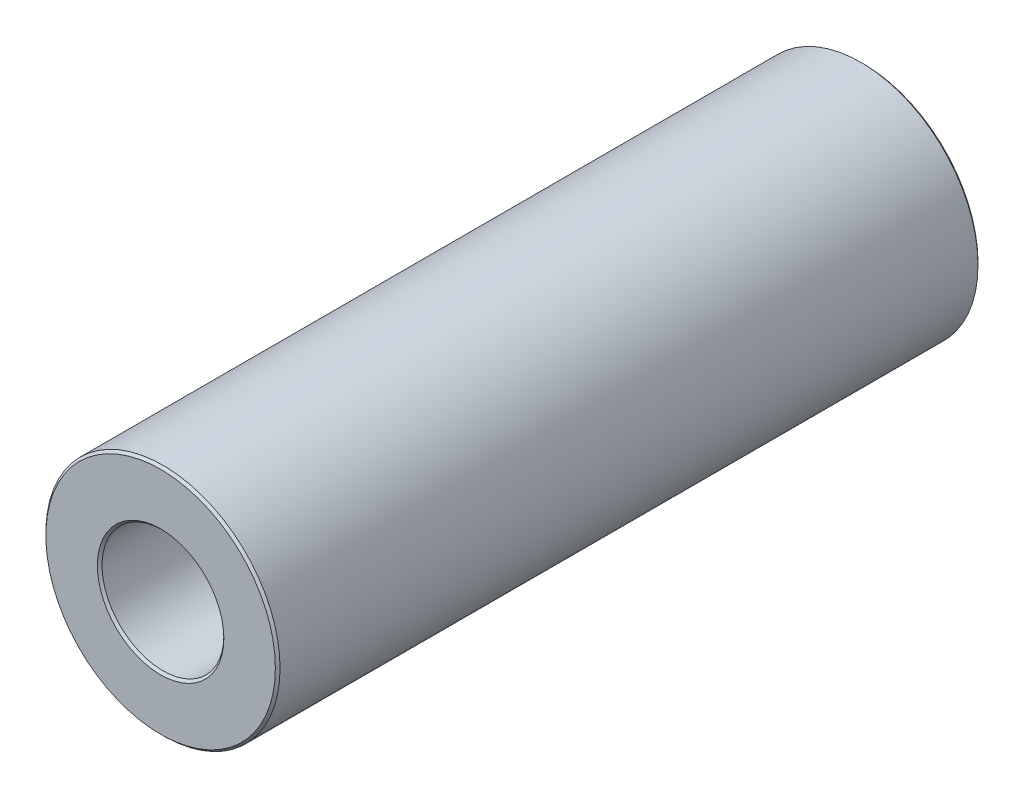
ISO-10303-21;
HEADER;
FILE_DESCRIPTION(('STEP AP214'),'2;1');
FILE_NAME('part.step','',(''),(''),'','','');
FILE_SCHEMA(('AUTOMOTIVE_DESIGN { 1 0 10303 214 1 1 1 1 }'));
ENDSEC;
DATA;
#1=APPLICATION_CONTEXT('core data for automotive mechanical design processes');
#2=APPLICATION_PROTOCOL_DEFINITION('international standard','automotive_design',2000,#1);
#3=PRODUCT_CONTEXT('',#1,'mechanical');
#4=PRODUCT('Part','Part','',(#3));
#5=PRODUCT_RELATED_PRODUCT_CATEGORY('part','',(#4));
#6=PRODUCT_DEFINITION_FORMATION('','',#4);
#7=PRODUCT_DEFINITION_CONTEXT('part definition',#1,'design');
#8=PRODUCT_DEFINITION('design','',#6,#7);
#9=PRODUCT_DEFINITION_SHAPE('','',#8);
#10=(LENGTH_UNIT() NAMED_UNIT(*) SI_UNIT(.MILLI.,.METRE.));
#11=(NAMED_UNIT(*) PLANE_ANGLE_UNIT() SI_UNIT($,.RADIAN.));
#12=(NAMED_UNIT(*) SI_UNIT($,.STERADIAN.) SOLID_ANGLE_UNIT());
#13=UNCERTAINTY_MEASURE_WITH_UNIT(LENGTH_MEASURE(1.E-05),#10,'distance_accuracy_value','');
#14=(GEOMETRIC_REPRESENTATION_CONTEXT(3) GLOBAL_UNCERTAINTY_ASSIGNED_CONTEXT((#13)) GLOBAL_UNIT_ASSIGNED_CONTEXT((#10,
#11,#12)) REPRESENTATION_CONTEXT('',''));
#15=CARTESIAN_POINT('',(0.,0.,0.));
#16=DIRECTION('',(0.,0.,1.));
#17=DIRECTION('',(1.,0.,0.));
#18=AXIS2_PLACEMENT_3D('',#15,#16,#17);
#19=CARTESIAN_POINT('',(0.,0.,15.));
#20=DIRECTION('',(0.,0.,1.));
#21=DIRECTION('',(1.,0.,0.));
#22=AXIS2_PLACEMENT_3D('',#19,#20,#21);
#23=PLANE('',#22);
#24=CARTESIAN_POINT('',(0.,0.,15.));
#25=DIRECTION('',(0.,0.,1.));
#26=DIRECTION('',(1.,0.,0.));
#27=AXIS2_PLACEMENT_3D('',#24,#25,#26);
#28=CIRCLE('',#27,2.7);
#29=CARTESIAN_POINT('',(2.7,0.,15.));
#30=VERTEX_POINT('',#29);
#31=EDGE_CURVE('E10',#30,#30,#28,.F.);
#32=ORIENTED_EDGE('',*,*,#31,.T.);
#33=EDGE_LOOP('',(#32));
#34=FACE_BOUND('',#33,.T.);
#35=CARTESIAN_POINT('',(0.,0.,15.));
#36=DIRECTION('',(0.,0.,1.));
#37=DIRECTION('',(1.,0.,0.));
#38=AXIS2_PLACEMENT_3D('',#35,#36,#37);
#39=CIRCLE('',#38,4.9);
#40=CARTESIAN_POINT('',(4.9,0.,15.));
#41=VERTEX_POINT('',#40);
#42=EDGE_CURVE('E45',#41,#41,#39,.T.);
#43=ORIENTED_EDGE('',*,*,#42,.T.);
#44=EDGE_LOOP('',(#43));
#45=FACE_BOUND('',#44,.T.);
#46=ADVANCED_FACE('F37',(#34,#45),#23,.T.);
#47=CARTESIAN_POINT('',(0.,0.,-15.));
#48=DIRECTION('',(0.,0.,1.));
#49=DIRECTION('',(1.,0.,0.));
#50=AXIS2_PLACEMENT_3D('',#47,#48,#49);
#51=PLANE('',#50);
#52=CARTESIAN_POINT('',(0.,0.,-15.));
#53=DIRECTION('',(0.,0.,1.));
#54=DIRECTION('',(1.,0.,0.));
#55=AXIS2_PLACEMENT_3D('',#52,#53,#54);
#56=CIRCLE('',#55,4.9);
#57=CARTESIAN_POINT('',(4.9,0.,-15.));
#58=VERTEX_POINT('',#57);
#59=EDGE_CURVE('E63',#58,#58,#56,.F.);
#60=ORIENTED_EDGE('',*,*,#59,.T.);
#61=EDGE_LOOP('',(#60));
#62=FACE_BOUND('',#61,.T.);
#63=CARTESIAN_POINT('',(0.,0.,-15.));
#64=DIRECTION('',(0.,0.,1.));
#65=DIRECTION('',(1.,0.,0.));
#66=AXIS2_PLACEMENT_3D('',#63,#64,#65);
#67=CIRCLE('',#66,2.7);
#68=CARTESIAN_POINT('',(2.7,0.,-15.));
#69=VERTEX_POINT('',#68);
#70=EDGE_CURVE('E66',#69,#69,#67,.T.);
#71=ORIENTED_EDGE('',*,*,#70,.T.);
#72=EDGE_LOOP('',(#71));
#73=FACE_BOUND('',#72,.T.);
#74=ADVANCED_FACE('F89',(#62,#73),#51,.F.);
#75=CARTESIAN_POINT('',(0.,0.,15.));
#76=DIRECTION('',(0.,0.,-1.));
#77=DIRECTION('',(-1.,0.,0.));
#78=AXIS2_PLACEMENT_3D('',#75,#76,#77);
#79=CYLINDRICAL_SURFACE('',#78,5.);
#80=CARTESIAN_POINT('',(0.,0.,-14.9));
#81=DIRECTION('',(0.,0.,1.));
#82=DIRECTION('',(1.,0.,0.));
#83=AXIS2_PLACEMENT_3D('',#80,#81,#82);
#84=CIRCLE('',#83,5.);
#85=CARTESIAN_POINT('',(5.,0.,-14.9));
#86=VERTEX_POINT('',#85);
#87=EDGE_CURVE('E69',#86,#86,#84,.T.);
#88=ORIENTED_EDGE('',*,*,#87,.T.);
#89=EDGE_LOOP('',(#88));
#90=FACE_BOUND('',#89,.T.);
#91=CARTESIAN_POINT('',(0.,0.,14.9));
#92=DIRECTION('',(0.,0.,1.));
#93=DIRECTION('',(1.,0.,0.));
#94=AXIS2_PLACEMENT_3D('',#91,#92,#93);
#95=CIRCLE('',#94,5.);
#96=CARTESIAN_POINT('',(5.,0.,14.9));
#97=VERTEX_POINT('',#96);
#98=EDGE_CURVE('E73',#97,#97,#95,.F.);
#99=ORIENTED_EDGE('',*,*,#98,.T.);
#100=EDGE_LOOP('',(#99));
#101=FACE_BOUND('',#100,.T.);
#102=ADVANCED_FACE('F78',(#90,#101),#79,.T.);
#103=CARTESIAN_POINT('',(0.,0.,15.));
#104=DIRECTION('',(0.,0.,-1.));
#105=DIRECTION('',(-1.,0.,0.));
#106=AXIS2_PLACEMENT_3D('',#103,#104,#105);
#107=CYLINDRICAL_SURFACE('',#106,2.6);
#108=CARTESIAN_POINT('',(0.,0.,-14.9));
#109=DIRECTION('',(0.,0.,1.));
#110=DIRECTION('',(1.,0.,0.));
#111=AXIS2_PLACEMENT_3D('',#108,#109,#110);
#112=CIRCLE('',#111,2.6);
#113=CARTESIAN_POINT('',(2.6,0.,-14.9));
#114=VERTEX_POINT('',#113);
#115=EDGE_CURVE('E52',#114,#114,#112,.F.);
#116=ORIENTED_EDGE('',*,*,#115,.T.);
#117=EDGE_LOOP('',(#116));
#118=FACE_BOUND('',#117,.T.);
#119=CARTESIAN_POINT('',(0.,0.,14.9));
#120=DIRECTION('',(0.,0.,1.));
#121=DIRECTION('',(1.,0.,0.));
#122=AXIS2_PLACEMENT_3D('',#119,#120,#121);
#123=CIRCLE('',#122,2.6);
#124=CARTESIAN_POINT('',(2.6,0.,14.9));
#125=VERTEX_POINT('',#124);
#126=EDGE_CURVE('E58',#125,#125,#123,.T.);
#127=ORIENTED_EDGE('',*,*,#126,.T.);
#128=EDGE_LOOP('',(#127));
#129=FACE_BOUND('',#128,.T.);
#130=ADVANCED_FACE('F97',(#118,#129),#107,.F.);
#131=CARTESIAN_POINT('',(0.,0.,-14.9));
#132=DIRECTION('',(0.,0.,1.));
#133=DIRECTION('',(1.,0.,0.));
#134=AXIS2_PLACEMENT_3D('',#131,#132,#133);
#135=CONICAL_SURFACE('',#134,5.,0.785398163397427);
#136=ORIENTED_EDGE('',*,*,#59,.F.);
#137=EDGE_LOOP('',(#136));
#138=FACE_BOUND('',#137,.T.);
#139=ORIENTED_EDGE('',*,*,#87,.F.);
#140=EDGE_LOOP('',(#139));
#141=FACE_BOUND('',#140,.T.);
#142=ADVANCED_FACE('F102',(#138,#141),#135,.T.);
#143=CARTESIAN_POINT('',(0.,0.,-15.));
#144=DIRECTION('',(0.,0.,-1.));
#145=DIRECTION('',(-1.,0.,0.));
#146=AXIS2_PLACEMENT_3D('',#143,#144,#145);
#147=CONICAL_SURFACE('',#146,2.7,0.78539816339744);
#148=ORIENTED_EDGE('',*,*,#115,.F.);
#149=EDGE_LOOP('',(#148));
#150=FACE_BOUND('',#149,.T.);
#151=ORIENTED_EDGE('',*,*,#70,.F.);
#152=EDGE_LOOP('',(#151));
#153=FACE_BOUND('',#152,.T.);
#154=ADVANCED_FACE('F86',(#150,#153),#147,.F.);
#155=CARTESIAN_POINT('',(0.,0.,14.9));
#156=DIRECTION('',(0.,0.,1.));
#157=DIRECTION('',(1.,0.,0.));
#158=AXIS2_PLACEMENT_3D('',#155,#156,#157);
#159=CONICAL_SURFACE('',#158,2.6,0.78539816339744);
#160=ORIENTED_EDGE('',*,*,#31,.F.);
#161=EDGE_LOOP('',(#160));
#162=FACE_BOUND('',#161,.T.);
#163=ORIENTED_EDGE('',*,*,#126,.F.);
#164=EDGE_LOOP('',(#163));
#165=FACE_BOUND('',#164,.T.);
#166=ADVANCED_FACE('F82',(#162,#165),#159,.F.);
#167=CARTESIAN_POINT('',(0.,0.,15.));
#168=DIRECTION('',(0.,0.,-1.));
#169=DIRECTION('',(-1.,0.,0.));
#170=AXIS2_PLACEMENT_3D('',#167,#168,#169);
#171=CONICAL_SURFACE('',#170,4.9,0.785398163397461);
#172=ORIENTED_EDGE('',*,*,#98,.F.);
#173=EDGE_LOOP('',(#172));
#174=FACE_BOUND('',#173,.T.);
#175=ORIENTED_EDGE('',*,*,#42,.F.);
#176=EDGE_LOOP('',(#175));
#177=FACE_BOUND('',#176,.T.);
#178=ADVANCED_FACE('F39',(#174,#177),#171,.T.);
#179=CLOSED_SHELL('',(#46,#74,#102,#130,#142,#154,#166,#178));
#180=MANIFOLD_SOLID_BREP('B2',#179);
#181=ADVANCED_BREP_SHAPE_REPRESENTATION('',(#18,#180),#14);
#182=SHAPE_DEFINITION_REPRESENTATION(#9,#181);
ENDSEC;
END-ISO-10303-21;
